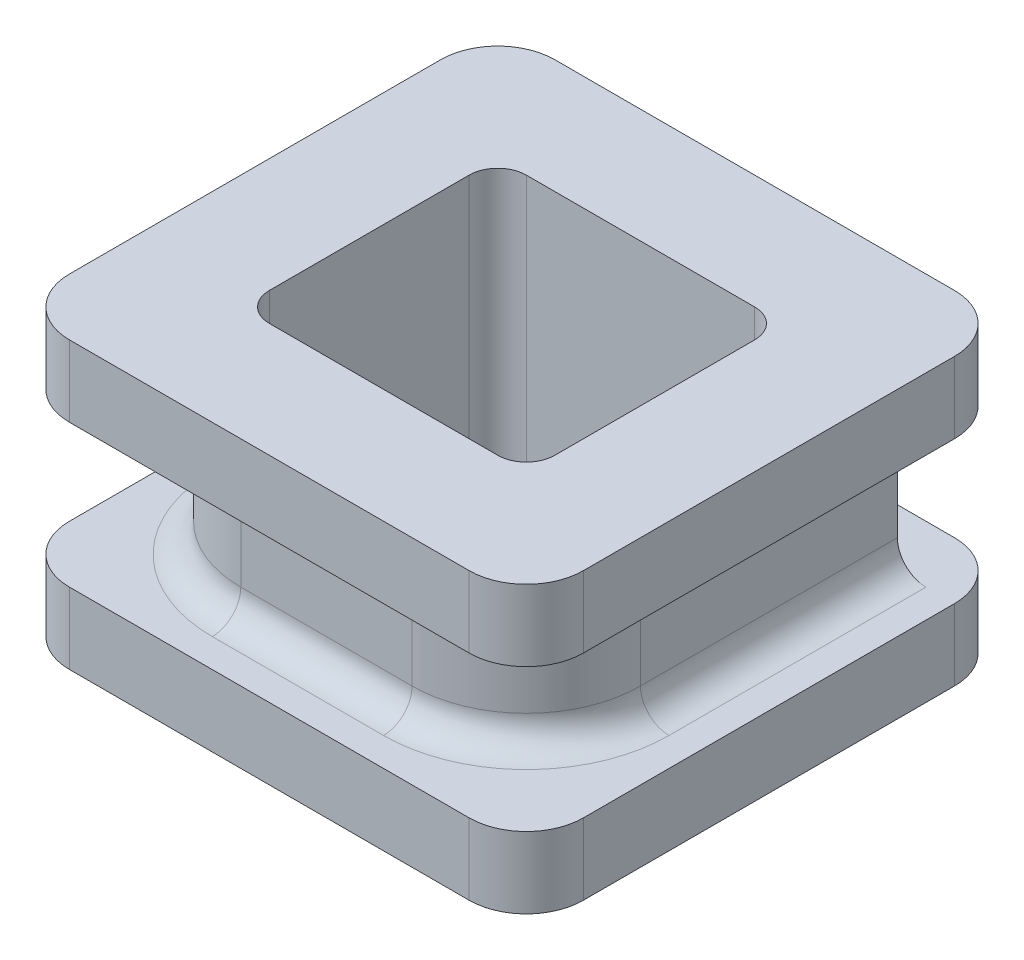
ISO-10303-21;
HEADER;
FILE_DESCRIPTION(('STEP AP214'),'2;1');
FILE_NAME('part.step','',(''),(''),'','','');
FILE_SCHEMA(('AUTOMOTIVE_DESIGN { 1 0 10303 214 1 1 1 1 }'));
ENDSEC;
DATA;
#1=APPLICATION_CONTEXT('core data for automotive mechanical design processes');
#2=APPLICATION_PROTOCOL_DEFINITION('international standard','automotive_design',2000,#1);
#3=PRODUCT_CONTEXT('',#1,'mechanical');
#4=PRODUCT('Part','Part','',(#3));
#5=PRODUCT_RELATED_PRODUCT_CATEGORY('part','',(#4));
#6=PRODUCT_DEFINITION_FORMATION('','',#4);
#7=PRODUCT_DEFINITION_CONTEXT('part definition',#1,'design');
#8=PRODUCT_DEFINITION('design','',#6,#7);
#9=PRODUCT_DEFINITION_SHAPE('','',#8);
#10=(LENGTH_UNIT() NAMED_UNIT(*) SI_UNIT(.MILLI.,.METRE.));
#11=(NAMED_UNIT(*) PLANE_ANGLE_UNIT() SI_UNIT($,.RADIAN.));
#12=(NAMED_UNIT(*) SI_UNIT($,.STERADIAN.) SOLID_ANGLE_UNIT());
#13=UNCERTAINTY_MEASURE_WITH_UNIT(LENGTH_MEASURE(1.E-05),#10,'distance_accuracy_value','');
#14=(GEOMETRIC_REPRESENTATION_CONTEXT(3) GLOBAL_UNCERTAINTY_ASSIGNED_CONTEXT((#13)) GLOBAL_UNIT_ASSIGNED_CONTEXT((#10,
#11,#12)) REPRESENTATION_CONTEXT('',''));
#15=CARTESIAN_POINT('',(0.,0.,0.));
#16=DIRECTION('',(0.,0.,1.));
#17=DIRECTION('',(1.,0.,0.));
#18=AXIS2_PLACEMENT_3D('',#15,#16,#17);
#19=CARTESIAN_POINT('',(14.,5.,0.));
#20=DIRECTION('',(1.,0.,0.));
#21=DIRECTION('',(0.,0.,-1.));
#22=AXIS2_PLACEMENT_3D('',#19,#20,#21);
#23=PLANE('',#22);
#24=DIRECTION('',(0.,0.,1.));
#25=VECTOR('',#24,1.);
#26=CARTESIAN_POINT('',(14.,-5.,0.));
#27=LINE('',#26,#25);
#28=CARTESIAN_POINT('',(14.,-5.,-11.));
#29=VERTEX_POINT('',#28);
#30=CARTESIAN_POINT('',(14.,-5.,2.));
#31=VERTEX_POINT('',#30);
#32=EDGE_CURVE('E478',#29,#31,#27,.T.);
#33=ORIENTED_EDGE('',*,*,#32,.F.);
#34=DIRECTION('',(0.,-1.,0.));
#35=VECTOR('',#34,1.);
#36=CARTESIAN_POINT('',(14.,5.,-11.));
#37=LINE('',#36,#35);
#38=CARTESIAN_POINT('',(14.,-2.5,-11.));
#39=VERTEX_POINT('',#38);
#40=EDGE_CURVE('E400',#29,#39,#37,.F.);
#41=ORIENTED_EDGE('',*,*,#40,.T.);
#42=DIRECTION('',(0.,0.,1.));
#43=VECTOR('',#42,1.);
#44=CARTESIAN_POINT('',(14.,-2.5,-13.));
#45=LINE('',#44,#43);
#46=CARTESIAN_POINT('',(14.,-2.5,2.));
#47=VERTEX_POINT('',#46);
#48=EDGE_CURVE('E579',#39,#47,#45,.T.);
#49=ORIENTED_EDGE('',*,*,#48,.T.);
#50=DIRECTION('',(0.,-1.,0.));
#51=VECTOR('',#50,1.);
#52=CARTESIAN_POINT('',(14.,-5.,2.));
#53=LINE('',#52,#51);
#54=EDGE_CURVE('E397',#47,#31,#53,.T.);
#55=ORIENTED_EDGE('',*,*,#54,.T.);
#56=EDGE_LOOP('',(#33,#41,#49,#55));
#57=FACE_BOUND('',#56,.T.);
#58=ADVANCED_FACE('F59',(#57),#23,.T.);
#59=CARTESIAN_POINT('',(0.,5.,-13.));
#60=DIRECTION('',(0.,0.,-1.));
#61=DIRECTION('',(-1.,0.,0.));
#62=AXIS2_PLACEMENT_3D('',#59,#60,#61);
#63=PLANE('',#62);
#64=DIRECTION('',(1.,0.,0.));
#65=VECTOR('',#64,1.);
#66=CARTESIAN_POINT('',(0.,-5.,-13.));
#67=LINE('',#66,#65);
#68=CARTESIAN_POINT('',(-2.,-5.,-13.));
#69=VERTEX_POINT('',#68);
#70=CARTESIAN_POINT('',(12.,-5.,-13.));
#71=VERTEX_POINT('',#70);
#72=EDGE_CURVE('E481',#69,#71,#67,.T.);
#73=ORIENTED_EDGE('',*,*,#72,.F.);
#74=DIRECTION('',(0.,-1.,0.));
#75=VECTOR('',#74,1.);
#76=CARTESIAN_POINT('',(-2.,-2.5,-13.));
#77=LINE('',#76,#75);
#78=CARTESIAN_POINT('',(-2.,-2.5,-13.));
#79=VERTEX_POINT('',#78);
#80=EDGE_CURVE('E361',#69,#79,#77,.F.);
#81=ORIENTED_EDGE('',*,*,#80,.T.);
#82=DIRECTION('',(1.,0.,0.));
#83=VECTOR('',#82,1.);
#84=CARTESIAN_POINT('',(-4.,-2.5,-13.));
#85=LINE('',#84,#83);
#86=CARTESIAN_POINT('',(12.,-2.5,-13.));
#87=VERTEX_POINT('',#86);
#88=EDGE_CURVE('E482',#79,#87,#85,.T.);
#89=ORIENTED_EDGE('',*,*,#88,.T.);
#90=DIRECTION('',(0.,-1.,0.));
#91=VECTOR('',#90,1.);
#92=CARTESIAN_POINT('',(12.,5.,-13.));
#93=LINE('',#92,#91);
#94=EDGE_CURVE('E358',#87,#71,#93,.T.);
#95=ORIENTED_EDGE('',*,*,#94,.T.);
#96=EDGE_LOOP('',(#73,#81,#89,#95));
#97=FACE_BOUND('',#96,.T.);
#98=ADVANCED_FACE('F632',(#97),#63,.T.);
#99=CARTESIAN_POINT('',(-4.,5.,0.));
#100=DIRECTION('',(1.,0.,0.));
#101=DIRECTION('',(0.,0.,-1.));
#102=AXIS2_PLACEMENT_3D('',#99,#100,#101);
#103=PLANE('',#102);
#104=DIRECTION('',(0.,0.,1.));
#105=VECTOR('',#104,1.);
#106=CARTESIAN_POINT('',(-4.,-2.5,-13.));
#107=LINE('',#106,#105);
#108=CARTESIAN_POINT('',(-4.,-2.5,-11.));
#109=VERTEX_POINT('',#108);
#110=CARTESIAN_POINT('',(-4.,-2.5,2.));
#111=VERTEX_POINT('',#110);
#112=EDGE_CURVE('E572',#109,#111,#107,.T.);
#113=ORIENTED_EDGE('',*,*,#112,.F.);
#114=DIRECTION('',(0.,-1.,0.));
#115=VECTOR('',#114,1.);
#116=CARTESIAN_POINT('',(-4.,-5.,-11.));
#117=LINE('',#116,#115);
#118=CARTESIAN_POINT('',(-4.,-5.,-11.));
#119=VERTEX_POINT('',#118);
#120=EDGE_CURVE('E346',#109,#119,#117,.T.);
#121=ORIENTED_EDGE('',*,*,#120,.T.);
#122=DIRECTION('',(0.,0.,1.));
#123=VECTOR('',#122,1.);
#124=CARTESIAN_POINT('',(-4.,-5.,0.));
#125=LINE('',#124,#123);
#126=CARTESIAN_POINT('',(-4.,-5.,2.));
#127=VERTEX_POINT('',#126);
#128=EDGE_CURVE('E485',#119,#127,#125,.T.);
#129=ORIENTED_EDGE('',*,*,#128,.T.);
#130=DIRECTION('',(0.,-1.,0.));
#131=VECTOR('',#130,1.);
#132=CARTESIAN_POINT('',(-4.,5.,2.));
#133=LINE('',#132,#131);
#134=EDGE_CURVE('E344',#127,#111,#133,.F.);
#135=ORIENTED_EDGE('',*,*,#134,.T.);
#136=EDGE_LOOP('',(#113,#121,#129,#135));
#137=FACE_BOUND('',#136,.T.);
#138=ADVANCED_FACE('F639',(#137),#103,.F.);
#139=CARTESIAN_POINT('',(0.,5.,4.));
#140=DIRECTION('',(0.,0.,-1.));
#141=DIRECTION('',(-1.,0.,0.));
#142=AXIS2_PLACEMENT_3D('',#139,#140,#141);
#143=PLANE('',#142);
#144=DIRECTION('',(1.,0.,0.));
#145=VECTOR('',#144,1.);
#146=CARTESIAN_POINT('',(0.,-5.,4.));
#147=LINE('',#146,#145);
#148=CARTESIAN_POINT('',(-2.,-5.,4.));
#149=VERTEX_POINT('',#148);
#150=CARTESIAN_POINT('',(12.,-5.,4.));
#151=VERTEX_POINT('',#150);
#152=EDGE_CURVE('E488',#149,#151,#147,.T.);
#153=ORIENTED_EDGE('',*,*,#152,.T.);
#154=DIRECTION('',(0.,-1.,0.));
#155=VECTOR('',#154,1.);
#156=CARTESIAN_POINT('',(12.,-2.5,4.));
#157=LINE('',#156,#155);
#158=CARTESIAN_POINT('',(12.,-2.5,4.));
#159=VERTEX_POINT('',#158);
#160=EDGE_CURVE('E415',#151,#159,#157,.F.);
#161=ORIENTED_EDGE('',*,*,#160,.T.);
#162=DIRECTION('',(1.,0.,0.));
#163=VECTOR('',#162,1.);
#164=CARTESIAN_POINT('',(-4.,-2.5,4.));
#165=LINE('',#164,#163);
#166=CARTESIAN_POINT('',(-2.,-2.5,4.));
#167=VERTEX_POINT('',#166);
#168=EDGE_CURVE('E575',#167,#159,#165,.T.);
#169=ORIENTED_EDGE('',*,*,#168,.F.);
#170=DIRECTION('',(0.,-1.,0.));
#171=VECTOR('',#170,1.);
#172=CARTESIAN_POINT('',(-2.,5.,4.));
#173=LINE('',#172,#171);
#174=EDGE_CURVE('E412',#167,#149,#173,.T.);
#175=ORIENTED_EDGE('',*,*,#174,.T.);
#176=EDGE_LOOP('',(#153,#161,#169,#175));
#177=FACE_BOUND('',#176,.T.);
#178=ADVANCED_FACE('F846',(#177),#143,.F.);
#179=CARTESIAN_POINT('',(10.,5.,0.));
#180=DIRECTION('',(-1.,0.,0.));
#181=DIRECTION('',(0.,0.,1.));
#182=AXIS2_PLACEMENT_3D('',#179,#180,#181);
#183=PLANE('',#182);
#184=DIRECTION('',(0.,0.,-1.));
#185=VECTOR('',#184,1.);
#186=CARTESIAN_POINT('',(10.,5.,0.));
#187=LINE('',#186,#185);
#188=CARTESIAN_POINT('',(10.,5.,-1.));
#189=VERTEX_POINT('',#188);
#190=CARTESIAN_POINT('',(10.,5.,-8.));
#191=VERTEX_POINT('',#190);
#192=EDGE_CURVE('E474',#189,#191,#187,.T.);
#193=ORIENTED_EDGE('',*,*,#192,.T.);
#194=DIRECTION('',(0.,-1.,0.));
#195=VECTOR('',#194,1.);
#196=CARTESIAN_POINT('',(10.,5.,-8.));
#197=LINE('',#196,#195);
#198=CARTESIAN_POINT('',(10.,-5.,-8.));
#199=VERTEX_POINT('',#198);
#200=EDGE_CURVE('E419',#191,#199,#197,.T.);
#201=ORIENTED_EDGE('',*,*,#200,.T.);
#202=DIRECTION('',(0.,0.,-1.));
#203=VECTOR('',#202,1.);
#204=CARTESIAN_POINT('',(10.,-5.,0.));
#205=LINE('',#204,#203);
#206=CARTESIAN_POINT('',(10.,-5.,-1.));
#207=VERTEX_POINT('',#206);
#208=EDGE_CURVE('E457',#207,#199,#205,.T.);
#209=ORIENTED_EDGE('',*,*,#208,.F.);
#210=DIRECTION('',(0.,-1.,0.));
#211=VECTOR('',#210,1.);
#212=CARTESIAN_POINT('',(10.,5.,-1.));
#213=LINE('',#212,#211);
#214=EDGE_CURVE('E417',#207,#189,#213,.F.);
#215=ORIENTED_EDGE('',*,*,#214,.T.);
#216=EDGE_LOOP('',(#193,#201,#209,#215));
#217=FACE_BOUND('',#216,.T.);
#218=ADVANCED_FACE('F607',(#217),#183,.T.);
#219=CARTESIAN_POINT('',(0.,5.,0.));
#220=DIRECTION('',(0.,0.,-1.));
#221=DIRECTION('',(-1.,0.,0.));
#222=AXIS2_PLACEMENT_3D('',#219,#220,#221);
#223=PLANE('',#222);
#224=DIRECTION('',(1.,0.,0.));
#225=VECTOR('',#224,1.);
#226=CARTESIAN_POINT('',(0.,5.,0.));
#227=LINE('',#226,#225);
#228=CARTESIAN_POINT('',(1.,5.,0.));
#229=VERTEX_POINT('',#228);
#230=CARTESIAN_POINT('',(9.,5.,0.));
#231=VERTEX_POINT('',#230);
#232=EDGE_CURVE('E465',#229,#231,#227,.T.);
#233=ORIENTED_EDGE('',*,*,#232,.T.);
#234=DIRECTION('',(0.,-1.,0.));
#235=VECTOR('',#234,1.);
#236=CARTESIAN_POINT('',(9.,-5.,0.));
#237=LINE('',#236,#235);
#238=CARTESIAN_POINT('',(9.,-5.,0.));
#239=VERTEX_POINT('',#238);
#240=EDGE_CURVE('E433',#231,#239,#237,.T.);
#241=ORIENTED_EDGE('',*,*,#240,.T.);
#242=DIRECTION('',(1.,0.,0.));
#243=VECTOR('',#242,1.);
#244=CARTESIAN_POINT('',(0.,-5.,0.));
#245=LINE('',#244,#243);
#246=CARTESIAN_POINT('',(1.,-5.,0.));
#247=VERTEX_POINT('',#246);
#248=EDGE_CURVE('E450',#247,#239,#245,.T.);
#249=ORIENTED_EDGE('',*,*,#248,.F.);
#250=DIRECTION('',(0.,-1.,0.));
#251=VECTOR('',#250,1.);
#252=CARTESIAN_POINT('',(1.,5.,0.));
#253=LINE('',#252,#251);
#254=EDGE_CURVE('E81',#247,#229,#253,.F.);
#255=ORIENTED_EDGE('',*,*,#254,.T.);
#256=EDGE_LOOP('',(#233,#241,#249,#255));
#257=FACE_BOUND('',#256,.T.);
#258=ADVANCED_FACE('F455',(#257),#223,.T.);
#259=CARTESIAN_POINT('',(0.,5.,0.));
#260=DIRECTION('',(-1.,0.,0.));
#261=DIRECTION('',(0.,0.,1.));
#262=AXIS2_PLACEMENT_3D('',#259,#260,#261);
#263=PLANE('',#262);
#264=DIRECTION('',(0.,0.,-1.));
#265=VECTOR('',#264,1.);
#266=CARTESIAN_POINT('',(0.,-5.,0.));
#267=LINE('',#266,#265);
#268=CARTESIAN_POINT('',(0.,-5.,-1.));
#269=VERTEX_POINT('',#268);
#270=CARTESIAN_POINT('',(0.,-5.,-8.));
#271=VERTEX_POINT('',#270);
#272=EDGE_CURVE('E452',#269,#271,#267,.T.);
#273=ORIENTED_EDGE('',*,*,#272,.T.);
#274=DIRECTION('',(0.,-1.,0.));
#275=VECTOR('',#274,1.);
#276=CARTESIAN_POINT('',(0.,5.,-8.));
#277=LINE('',#276,#275);
#278=CARTESIAN_POINT('',(0.,5.,-8.));
#279=VERTEX_POINT('',#278);
#280=EDGE_CURVE('E430',#271,#279,#277,.F.);
#281=ORIENTED_EDGE('',*,*,#280,.T.);
#282=DIRECTION('',(0.,0.,-1.));
#283=VECTOR('',#282,1.);
#284=CARTESIAN_POINT('',(0.,5.,0.));
#285=LINE('',#284,#283);
#286=CARTESIAN_POINT('',(0.,5.,-1.));
#287=VERTEX_POINT('',#286);
#288=EDGE_CURVE('E463',#287,#279,#285,.T.);
#289=ORIENTED_EDGE('',*,*,#288,.F.);
#290=DIRECTION('',(0.,-1.,0.));
#291=VECTOR('',#290,1.);
#292=CARTESIAN_POINT('',(0.,5.,-1.));
#293=LINE('',#292,#291);
#294=EDGE_CURVE('E427',#287,#269,#293,.T.);
#295=ORIENTED_EDGE('',*,*,#294,.T.);
#296=EDGE_LOOP('',(#273,#281,#289,#295));
#297=FACE_BOUND('',#296,.T.);
#298=ADVANCED_FACE('F467',(#297),#263,.F.);
#299=DIRECTION('',(0.,0.,1.));
#300=VECTOR('',#299,1.);
#301=CARTESIAN_POINT('',(14.,2.5,-13.));
#302=LINE('',#301,#300);
#303=CARTESIAN_POINT('',(14.,2.5,-11.));
#304=VERTEX_POINT('',#303);
#305=CARTESIAN_POINT('',(14.,2.5,2.));
#306=VERTEX_POINT('',#305);
#307=EDGE_CURVE('E589',#304,#306,#302,.T.);
#308=ORIENTED_EDGE('',*,*,#307,.F.);
#309=DIRECTION('',(0.,-1.,0.));
#310=VECTOR('',#309,1.);
#311=CARTESIAN_POINT('',(14.,5.,-11.));
#312=LINE('',#311,#310);
#313=CARTESIAN_POINT('',(14.,5.,-11.));
#314=VERTEX_POINT('',#313);
#315=EDGE_CURVE('E405',#304,#314,#312,.F.);
#316=ORIENTED_EDGE('',*,*,#315,.T.);
#317=DIRECTION('',(0.,0.,1.));
#318=VECTOR('',#317,1.);
#319=CARTESIAN_POINT('',(14.,5.,0.));
#320=LINE('',#319,#318);
#321=CARTESIAN_POINT('',(14.,5.,2.));
#322=VERTEX_POINT('',#321);
#323=EDGE_CURVE('E497',#314,#322,#320,.T.);
#324=ORIENTED_EDGE('',*,*,#323,.T.);
#325=DIRECTION('',(0.,-1.,0.));
#326=VECTOR('',#325,1.);
#327=CARTESIAN_POINT('',(14.,2.5,2.));
#328=LINE('',#327,#326);
#329=EDGE_CURVE('E402',#322,#306,#328,.T.);
#330=ORIENTED_EDGE('',*,*,#329,.T.);
#331=EDGE_LOOP('',(#308,#316,#324,#330));
#332=FACE_BOUND('',#331,.T.);
#333=ADVANCED_FACE('F635',(#332),#23,.T.);
#334=DIRECTION('',(1.,0.,0.));
#335=VECTOR('',#334,1.);
#336=CARTESIAN_POINT('',(-4.,2.5,-13.));
#337=LINE('',#336,#335);
#338=CARTESIAN_POINT('',(-2.,2.5,-13.));
#339=VERTEX_POINT('',#338);
#340=CARTESIAN_POINT('',(12.,2.5,-13.));
#341=VERTEX_POINT('',#340);
#342=EDGE_CURVE('E576',#339,#341,#337,.T.);
#343=ORIENTED_EDGE('',*,*,#342,.F.);
#344=DIRECTION('',(0.,-1.,0.));
#345=VECTOR('',#344,1.);
#346=CARTESIAN_POINT('',(-2.,5.,-13.));
#347=LINE('',#346,#345);
#348=CARTESIAN_POINT('',(-2.,5.,-13.));
#349=VERTEX_POINT('',#348);
#350=EDGE_CURVE('E387',#339,#349,#347,.F.);
#351=ORIENTED_EDGE('',*,*,#350,.T.);
#352=DIRECTION('',(1.,0.,0.));
#353=VECTOR('',#352,1.);
#354=CARTESIAN_POINT('',(0.,5.,-13.));
#355=LINE('',#354,#353);
#356=CARTESIAN_POINT('',(12.,5.,-13.));
#357=VERTEX_POINT('',#356);
#358=EDGE_CURVE('E596',#349,#357,#355,.T.);
#359=ORIENTED_EDGE('',*,*,#358,.T.);
#360=DIRECTION('',(0.,-1.,0.));
#361=VECTOR('',#360,1.);
#362=CARTESIAN_POINT('',(12.,5.,-13.));
#363=LINE('',#362,#361);
#364=EDGE_CURVE('E384',#357,#341,#363,.T.);
#365=ORIENTED_EDGE('',*,*,#364,.T.);
#366=EDGE_LOOP('',(#343,#351,#359,#365));
#367=FACE_BOUND('',#366,.T.);
#368=ADVANCED_FACE('F642',(#367),#63,.T.);
#369=DIRECTION('',(0.,0.,1.));
#370=VECTOR('',#369,1.);
#371=CARTESIAN_POINT('',(-4.,5.,0.));
#372=LINE('',#371,#370);
#373=CARTESIAN_POINT('',(-4.,5.,-11.));
#374=VERTEX_POINT('',#373);
#375=CARTESIAN_POINT('',(-4.,5.,2.));
#376=VERTEX_POINT('',#375);
#377=EDGE_CURVE('E599',#374,#376,#372,.T.);
#378=ORIENTED_EDGE('',*,*,#377,.F.);
#379=DIRECTION('',(0.,-1.,0.));
#380=VECTOR('',#379,1.);
#381=CARTESIAN_POINT('',(-4.,2.5,-11.));
#382=LINE('',#381,#380);
#383=CARTESIAN_POINT('',(-4.,2.5,-11.));
#384=VERTEX_POINT('',#383);
#385=EDGE_CURVE('E373',#374,#384,#382,.T.);
#386=ORIENTED_EDGE('',*,*,#385,.T.);
#387=DIRECTION('',(0.,0.,1.));
#388=VECTOR('',#387,1.);
#389=CARTESIAN_POINT('',(-4.,2.5,-13.));
#390=LINE('',#389,#388);
#391=CARTESIAN_POINT('',(-4.,2.5,2.));
#392=VERTEX_POINT('',#391);
#393=EDGE_CURVE('E571',#384,#392,#390,.T.);
#394=ORIENTED_EDGE('',*,*,#393,.T.);
#395=DIRECTION('',(0.,-1.,0.));
#396=VECTOR('',#395,1.);
#397=CARTESIAN_POINT('',(-4.,5.,2.));
#398=LINE('',#397,#396);
#399=EDGE_CURVE('E371',#392,#376,#398,.F.);
#400=ORIENTED_EDGE('',*,*,#399,.T.);
#401=EDGE_LOOP('',(#378,#386,#394,#400));
#402=FACE_BOUND('',#401,.T.);
#403=ADVANCED_FACE('F651',(#402),#103,.F.);
#404=DIRECTION('',(1.,0.,0.));
#405=VECTOR('',#404,1.);
#406=CARTESIAN_POINT('',(-4.,2.5,4.));
#407=LINE('',#406,#405);
#408=CARTESIAN_POINT('',(-2.,2.5,4.));
#409=VERTEX_POINT('',#408);
#410=CARTESIAN_POINT('',(12.,2.5,4.));
#411=VERTEX_POINT('',#410);
#412=EDGE_CURVE('E586',#409,#411,#407,.T.);
#413=ORIENTED_EDGE('',*,*,#412,.T.);
#414=DIRECTION('',(0.,-1.,0.));
#415=VECTOR('',#414,1.);
#416=CARTESIAN_POINT('',(12.,5.,4.));
#417=LINE('',#416,#415);
#418=CARTESIAN_POINT('',(12.,5.,4.));
#419=VERTEX_POINT('',#418);
#420=EDGE_CURVE('E410',#411,#419,#417,.F.);
#421=ORIENTED_EDGE('',*,*,#420,.T.);
#422=DIRECTION('',(1.,0.,0.));
#423=VECTOR('',#422,1.);
#424=CARTESIAN_POINT('',(0.,5.,4.));
#425=LINE('',#424,#423);
#426=CARTESIAN_POINT('',(-2.,5.,4.));
#427=VERTEX_POINT('',#426);
#428=EDGE_CURVE('E602',#427,#419,#425,.T.);
#429=ORIENTED_EDGE('',*,*,#428,.F.);
#430=DIRECTION('',(0.,-1.,0.));
#431=VECTOR('',#430,1.);
#432=CARTESIAN_POINT('',(-2.,5.,4.));
#433=LINE('',#432,#431);
#434=EDGE_CURVE('E407',#427,#409,#433,.T.);
#435=ORIENTED_EDGE('',*,*,#434,.T.);
#436=EDGE_LOOP('',(#413,#421,#429,#435));
#437=FACE_BOUND('',#436,.T.);
#438=ADVANCED_FACE('F681',(#437),#143,.F.);
#439=CARTESIAN_POINT('',(0.,5.,-9.));
#440=DIRECTION('',(0.,0.,-1.));
#441=DIRECTION('',(-1.,0.,0.));
#442=AXIS2_PLACEMENT_3D('',#439,#440,#441);
#443=PLANE('',#442);
#444=DIRECTION('',(1.,0.,0.));
#445=VECTOR('',#444,1.);
#446=CARTESIAN_POINT('',(0.,-5.,-9.));
#447=LINE('',#446,#445);
#448=CARTESIAN_POINT('',(1.,-5.,-9.));
#449=VERTEX_POINT('',#448);
#450=CARTESIAN_POINT('',(9.,-5.,-9.));
#451=VERTEX_POINT('',#450);
#452=EDGE_CURVE('E494',#449,#451,#447,.T.);
#453=ORIENTED_EDGE('',*,*,#452,.T.);
#454=DIRECTION('',(0.,-1.,0.));
#455=VECTOR('',#454,1.);
#456=CARTESIAN_POINT('',(9.,5.,-9.));
#457=LINE('',#456,#455);
#458=CARTESIAN_POINT('',(9.,5.,-9.));
#459=VERTEX_POINT('',#458);
#460=EDGE_CURVE('E425',#451,#459,#457,.F.);
#461=ORIENTED_EDGE('',*,*,#460,.T.);
#462=DIRECTION('',(1.,0.,0.));
#463=VECTOR('',#462,1.);
#464=CARTESIAN_POINT('',(0.,5.,-9.));
#465=LINE('',#464,#463);
#466=CARTESIAN_POINT('',(1.,5.,-9.));
#467=VERTEX_POINT('',#466);
#468=EDGE_CURVE('E469',#467,#459,#465,.T.);
#469=ORIENTED_EDGE('',*,*,#468,.F.);
#470=DIRECTION('',(0.,-1.,0.));
#471=VECTOR('',#470,1.);
#472=CARTESIAN_POINT('',(1.,-5.,-9.));
#473=LINE('',#472,#471);
#474=EDGE_CURVE('E422',#467,#449,#473,.T.);
#475=ORIENTED_EDGE('',*,*,#474,.T.);
#476=EDGE_LOOP('',(#453,#461,#469,#475));
#477=FACE_BOUND('',#476,.T.);
#478=ADVANCED_FACE('F616',(#477),#443,.F.);
#479=CARTESIAN_POINT('',(0.,5.,0.));
#480=DIRECTION('',(0.,1.,0.));
#481=DIRECTION('',(0.,0.,1.));
#482=AXIS2_PLACEMENT_3D('',#479,#480,#481);
#483=PLANE('',#482);
#484=ORIENTED_EDGE('',*,*,#358,.F.);
#485=CARTESIAN_POINT('',(-2.,5.,-11.));
#486=DIRECTION('',(0.,1.,0.));
#487=DIRECTION('',(0.,0.,1.));
#488=AXIS2_PLACEMENT_3D('',#485,#486,#487);
#489=CIRCLE('',#488,2.);
#490=EDGE_CURVE('E395',#349,#374,#489,.T.);
#491=ORIENTED_EDGE('',*,*,#490,.T.);
#492=ORIENTED_EDGE('',*,*,#377,.T.);
#493=CARTESIAN_POINT('',(-2.,5.,2.));
#494=DIRECTION('',(0.,1.,0.));
#495=DIRECTION('',(0.,0.,1.));
#496=AXIS2_PLACEMENT_3D('',#493,#494,#495);
#497=CIRCLE('',#496,2.);
#498=EDGE_CURVE('E389',#376,#427,#497,.T.);
#499=ORIENTED_EDGE('',*,*,#498,.T.);
#500=ORIENTED_EDGE('',*,*,#428,.T.);
#501=CARTESIAN_POINT('',(12.,5.,2.));
#502=DIRECTION('',(0.,1.,0.));
#503=DIRECTION('',(0.,0.,1.));
#504=AXIS2_PLACEMENT_3D('',#501,#502,#503);
#505=CIRCLE('',#504,2.);
#506=EDGE_CURVE('E391',#419,#322,#505,.T.);
#507=ORIENTED_EDGE('',*,*,#506,.T.);
#508=ORIENTED_EDGE('',*,*,#323,.F.);
#509=CARTESIAN_POINT('',(12.,5.,-11.));
#510=DIRECTION('',(0.,1.,0.));
#511=DIRECTION('',(0.,0.,1.));
#512=AXIS2_PLACEMENT_3D('',#509,#510,#511);
#513=CIRCLE('',#512,2.);
#514=EDGE_CURVE('E393',#314,#357,#513,.T.);
#515=ORIENTED_EDGE('',*,*,#514,.T.);
#516=EDGE_LOOP('',(#484,#491,#492,#499,#500,#507,#508,#515));
#517=FACE_BOUND('',#516,.T.);
#518=ORIENTED_EDGE('',*,*,#192,.F.);
#519=CARTESIAN_POINT('',(9.,5.,-1.));
#520=DIRECTION('',(0.,1.,0.));
#521=DIRECTION('',(0.,0.,1.));
#522=AXIS2_PLACEMENT_3D('',#519,#520,#521);
#523=CIRCLE('',#522,1.);
#524=EDGE_CURVE('E74',#189,#231,#523,.F.);
#525=ORIENTED_EDGE('',*,*,#524,.T.);
#526=ORIENTED_EDGE('',*,*,#232,.F.);
#527=CARTESIAN_POINT('',(1.,5.,-1.));
#528=DIRECTION('',(0.,1.,0.));
#529=DIRECTION('',(0.,0.,1.));
#530=AXIS2_PLACEMENT_3D('',#527,#528,#529);
#531=CIRCLE('',#530,1.);
#532=EDGE_CURVE('E12',#229,#287,#531,.F.);
#533=ORIENTED_EDGE('',*,*,#532,.T.);
#534=ORIENTED_EDGE('',*,*,#288,.T.);
#535=CARTESIAN_POINT('',(1.,5.,-8.));
#536=DIRECTION('',(0.,1.,0.));
#537=DIRECTION('',(0.,0.,1.));
#538=AXIS2_PLACEMENT_3D('',#535,#536,#537);
#539=CIRCLE('',#538,1.);
#540=EDGE_CURVE('E442',#279,#467,#539,.F.);
#541=ORIENTED_EDGE('',*,*,#540,.T.);
#542=ORIENTED_EDGE('',*,*,#468,.T.);
#543=CARTESIAN_POINT('',(9.,5.,-8.));
#544=DIRECTION('',(0.,1.,0.));
#545=DIRECTION('',(0.,0.,1.));
#546=AXIS2_PLACEMENT_3D('',#543,#544,#545);
#547=CIRCLE('',#546,1.);
#548=EDGE_CURVE('E438',#459,#191,#547,.F.);
#549=ORIENTED_EDGE('',*,*,#548,.T.);
#550=EDGE_LOOP('',(#518,#525,#526,#533,#534,#541,#542,#549));
#551=FACE_BOUND('',#550,.T.);
#552=ADVANCED_FACE('F462',(#517,#551),#483,.T.);
#553=CARTESIAN_POINT('',(0.,-5.,0.));
#554=DIRECTION('',(0.,1.,0.));
#555=DIRECTION('',(0.,0.,1.));
#556=AXIS2_PLACEMENT_3D('',#553,#554,#555);
#557=PLANE('',#556);
#558=ORIENTED_EDGE('',*,*,#128,.F.);
#559=CARTESIAN_POINT('',(-2.,-5.,-11.));
#560=DIRECTION('',(0.,1.,0.));
#561=DIRECTION('',(0.,0.,1.));
#562=AXIS2_PLACEMENT_3D('',#559,#560,#561);
#563=CIRCLE('',#562,2.);
#564=EDGE_CURVE('E356',#119,#69,#563,.F.);
#565=ORIENTED_EDGE('',*,*,#564,.T.);
#566=ORIENTED_EDGE('',*,*,#72,.T.);
#567=CARTESIAN_POINT('',(12.,-5.,-11.));
#568=DIRECTION('',(0.,1.,0.));
#569=DIRECTION('',(0.,0.,1.));
#570=AXIS2_PLACEMENT_3D('',#567,#568,#569);
#571=CIRCLE('',#570,2.);
#572=EDGE_CURVE('E354',#71,#29,#571,.F.);
#573=ORIENTED_EDGE('',*,*,#572,.T.);
#574=ORIENTED_EDGE('',*,*,#32,.T.);
#575=CARTESIAN_POINT('',(12.,-5.,2.));
#576=DIRECTION('',(0.,1.,0.));
#577=DIRECTION('',(0.,0.,1.));
#578=AXIS2_PLACEMENT_3D('',#575,#576,#577);
#579=CIRCLE('',#578,2.);
#580=EDGE_CURVE('E352',#31,#151,#579,.F.);
#581=ORIENTED_EDGE('',*,*,#580,.T.);
#582=ORIENTED_EDGE('',*,*,#152,.F.);
#583=CARTESIAN_POINT('',(-2.,-5.,2.));
#584=DIRECTION('',(0.,1.,0.));
#585=DIRECTION('',(0.,0.,1.));
#586=AXIS2_PLACEMENT_3D('',#583,#584,#585);
#587=CIRCLE('',#586,2.);
#588=EDGE_CURVE('E350',#149,#127,#587,.F.);
#589=ORIENTED_EDGE('',*,*,#588,.T.);
#590=EDGE_LOOP('',(#558,#565,#566,#573,#574,#581,#582,#589));
#591=FACE_BOUND('',#590,.T.);
#592=ORIENTED_EDGE('',*,*,#248,.T.);
#593=CARTESIAN_POINT('',(9.,-5.,-1.));
#594=DIRECTION('',(0.,1.,0.));
#595=DIRECTION('',(0.,0.,1.));
#596=AXIS2_PLACEMENT_3D('',#593,#594,#595);
#597=CIRCLE('',#596,1.);
#598=EDGE_CURVE('E444',#239,#207,#597,.T.);
#599=ORIENTED_EDGE('',*,*,#598,.T.);
#600=ORIENTED_EDGE('',*,*,#208,.T.);
#601=CARTESIAN_POINT('',(9.,-5.,-8.));
#602=DIRECTION('',(0.,1.,0.));
#603=DIRECTION('',(0.,0.,1.));
#604=AXIS2_PLACEMENT_3D('',#601,#602,#603);
#605=CIRCLE('',#604,1.);
#606=EDGE_CURVE('E436',#199,#451,#605,.T.);
#607=ORIENTED_EDGE('',*,*,#606,.T.);
#608=ORIENTED_EDGE('',*,*,#452,.F.);
#609=CARTESIAN_POINT('',(1.,-5.,-8.));
#610=DIRECTION('',(0.,1.,0.));
#611=DIRECTION('',(0.,0.,1.));
#612=AXIS2_PLACEMENT_3D('',#609,#610,#611);
#613=CIRCLE('',#612,1.);
#614=EDGE_CURVE('E440',#449,#271,#613,.T.);
#615=ORIENTED_EDGE('',*,*,#614,.T.);
#616=ORIENTED_EDGE('',*,*,#272,.F.);
#617=CARTESIAN_POINT('',(1.,-5.,-1.));
#618=DIRECTION('',(0.,1.,0.));
#619=DIRECTION('',(0.,0.,1.));
#620=AXIS2_PLACEMENT_3D('',#617,#618,#619);
#621=CIRCLE('',#620,1.);
#622=EDGE_CURVE('E67',#269,#247,#621,.T.);
#623=ORIENTED_EDGE('',*,*,#622,.T.);
#624=EDGE_LOOP('',(#592,#599,#600,#607,#608,#615,#616,#623));
#625=FACE_BOUND('',#624,.T.);
#626=ADVANCED_FACE('F449',(#591,#625),#557,.F.);
#627=CARTESIAN_POINT('',(0.,-2.5,0.));
#628=DIRECTION('',(0.,1.,0.));
#629=DIRECTION('',(0.,0.,1.));
#630=AXIS2_PLACEMENT_3D('',#627,#628,#629);
#631=PLANE('',#630);
#632=ORIENTED_EDGE('',*,*,#88,.F.);
#633=CARTESIAN_POINT('',(-2.,-2.5,-11.));
#634=DIRECTION('',(0.,1.,0.));
#635=DIRECTION('',(0.,0.,1.));
#636=AXIS2_PLACEMENT_3D('',#633,#634,#635);
#637=CIRCLE('',#636,2.);
#638=EDGE_CURVE('E369',#79,#109,#637,.T.);
#639=ORIENTED_EDGE('',*,*,#638,.T.);
#640=ORIENTED_EDGE('',*,*,#112,.T.);
#641=CARTESIAN_POINT('',(-2.,-2.5,2.));
#642=DIRECTION('',(0.,1.,0.));
#643=DIRECTION('',(0.,0.,1.));
#644=AXIS2_PLACEMENT_3D('',#641,#642,#643);
#645=CIRCLE('',#644,2.);
#646=EDGE_CURVE('E363',#111,#167,#645,.T.);
#647=ORIENTED_EDGE('',*,*,#646,.T.);
#648=ORIENTED_EDGE('',*,*,#168,.T.);
#649=CARTESIAN_POINT('',(12.,-2.5,2.));
#650=DIRECTION('',(0.,1.,0.));
#651=DIRECTION('',(0.,0.,1.));
#652=AXIS2_PLACEMENT_3D('',#649,#650,#651);
#653=CIRCLE('',#652,2.);
#654=EDGE_CURVE('E365',#159,#47,#653,.T.);
#655=ORIENTED_EDGE('',*,*,#654,.T.);
#656=ORIENTED_EDGE('',*,*,#48,.F.);
#657=CARTESIAN_POINT('',(12.,-2.5,-11.));
#658=DIRECTION('',(0.,1.,0.));
#659=DIRECTION('',(0.,0.,1.));
#660=AXIS2_PLACEMENT_3D('',#657,#658,#659);
#661=CIRCLE('',#660,2.);
#662=EDGE_CURVE('E367',#39,#87,#661,.T.);
#663=ORIENTED_EDGE('',*,*,#662,.T.);
#664=EDGE_LOOP('',(#632,#639,#640,#647,#648,#655,#656,#663));
#665=FACE_BOUND('',#664,.T.);
#666=DIRECTION('',(0.,0.,-1.));
#667=VECTOR('',#666,1.);
#668=CARTESIAN_POINT('',(-3.,-2.5,0.));
#669=LINE('',#668,#667);
#670=CARTESIAN_POINT('',(-3.,-2.5,-2.));
#671=VERTEX_POINT('',#670);
#672=CARTESIAN_POINT('',(-3.,-2.5,-11.));
#673=VERTEX_POINT('',#672);
#674=EDGE_CURVE('E330',#671,#673,#669,.T.);
#675=ORIENTED_EDGE('',*,*,#674,.T.);
#676=DIRECTION('',(1.,0.,0.));
#677=VECTOR('',#676,1.);
#678=CARTESIAN_POINT('',(-2.,-2.5,-11.));
#679=LINE('',#678,#677);
#680=CARTESIAN_POINT('',(13.,-2.5,-11.));
#681=VERTEX_POINT('',#680);
#682=EDGE_CURVE('E562',#673,#681,#679,.T.);
#683=ORIENTED_EDGE('',*,*,#682,.T.);
#684=DIRECTION('',(0.,0.,-1.));
#685=VECTOR('',#684,1.);
#686=CARTESIAN_POINT('',(13.,-2.5,-2.));
#687=LINE('',#686,#685);
#688=CARTESIAN_POINT('',(13.,-2.5,-2.));
#689=VERTEX_POINT('',#688);
#690=EDGE_CURVE('E528',#681,#689,#687,.F.);
#691=ORIENTED_EDGE('',*,*,#690,.T.);
#692=CARTESIAN_POINT('',(8.,-2.5,-2.));
#693=DIRECTION('',(0.,1.,0.));
#694=DIRECTION('',(0.,0.,1.));
#695=AXIS2_PLACEMENT_3D('',#692,#693,#694);
#696=CIRCLE('',#695,5.);
#697=CARTESIAN_POINT('',(8.,-2.5,3.));
#698=VERTEX_POINT('',#697);
#699=EDGE_CURVE('E530',#689,#698,#696,.F.);
#700=ORIENTED_EDGE('',*,*,#699,.T.);
#701=DIRECTION('',(1.,0.,0.));
#702=VECTOR('',#701,1.);
#703=CARTESIAN_POINT('',(2.,-2.5,3.));
#704=LINE('',#703,#702);
#705=CARTESIAN_POINT('',(2.,-2.5,3.));
#706=VERTEX_POINT('',#705);
#707=EDGE_CURVE('E532',#698,#706,#704,.F.);
#708=ORIENTED_EDGE('',*,*,#707,.T.);
#709=CARTESIAN_POINT('',(2.,-2.5,-2.));
#710=DIRECTION('',(0.,1.,0.));
#711=DIRECTION('',(0.,0.,1.));
#712=AXIS2_PLACEMENT_3D('',#709,#710,#711);
#713=CIRCLE('',#712,5.);
#714=EDGE_CURVE('E534',#706,#671,#713,.F.);
#715=ORIENTED_EDGE('',*,*,#714,.T.);
#716=EDGE_LOOP('',(#675,#683,#691,#700,#708,#715));
#717=FACE_BOUND('',#716,.T.);
#718=ADVANCED_FACE('F689',(#665,#717),#631,.T.);
#719=CARTESIAN_POINT('',(0.,2.5,0.));
#720=DIRECTION('',(0.,1.,0.));
#721=DIRECTION('',(0.,0.,1.));
#722=AXIS2_PLACEMENT_3D('',#719,#720,#721);
#723=PLANE('',#722);
#724=ORIENTED_EDGE('',*,*,#393,.F.);
#725=CARTESIAN_POINT('',(-2.,2.5,-11.));
#726=DIRECTION('',(0.,1.,0.));
#727=DIRECTION('',(0.,0.,1.));
#728=AXIS2_PLACEMENT_3D('',#725,#726,#727);
#729=CIRCLE('',#728,2.);
#730=EDGE_CURVE('E382',#384,#339,#729,.F.);
#731=ORIENTED_EDGE('',*,*,#730,.T.);
#732=ORIENTED_EDGE('',*,*,#342,.T.);
#733=CARTESIAN_POINT('',(12.,2.5,-11.));
#734=DIRECTION('',(0.,1.,0.));
#735=DIRECTION('',(0.,0.,1.));
#736=AXIS2_PLACEMENT_3D('',#733,#734,#735);
#737=CIRCLE('',#736,2.);
#738=EDGE_CURVE('E380',#341,#304,#737,.F.);
#739=ORIENTED_EDGE('',*,*,#738,.T.);
#740=ORIENTED_EDGE('',*,*,#307,.T.);
#741=CARTESIAN_POINT('',(12.,2.5,2.));
#742=DIRECTION('',(0.,1.,0.));
#743=DIRECTION('',(0.,0.,1.));
#744=AXIS2_PLACEMENT_3D('',#741,#742,#743);
#745=CIRCLE('',#744,2.);
#746=EDGE_CURVE('E378',#306,#411,#745,.F.);
#747=ORIENTED_EDGE('',*,*,#746,.T.);
#748=ORIENTED_EDGE('',*,*,#412,.F.);
#749=CARTESIAN_POINT('',(-2.,2.5,2.));
#750=DIRECTION('',(0.,1.,0.));
#751=DIRECTION('',(0.,0.,1.));
#752=AXIS2_PLACEMENT_3D('',#749,#750,#751);
#753=CIRCLE('',#752,2.);
#754=EDGE_CURVE('E376',#409,#392,#753,.F.);
#755=ORIENTED_EDGE('',*,*,#754,.T.);
#756=EDGE_LOOP('',(#724,#731,#732,#739,#740,#747,#748,#755));
#757=FACE_BOUND('',#756,.T.);
#758=DIRECTION('',(0.,0.,-1.));
#759=VECTOR('',#758,1.);
#760=CARTESIAN_POINT('',(13.,2.5,0.));
#761=LINE('',#760,#759);
#762=CARTESIAN_POINT('',(13.,2.5,-2.));
#763=VERTEX_POINT('',#762);
#764=CARTESIAN_POINT('',(13.,2.5,-11.));
#765=VERTEX_POINT('',#764);
#766=EDGE_CURVE('E511',#763,#765,#761,.T.);
#767=ORIENTED_EDGE('',*,*,#766,.T.);
#768=DIRECTION('',(1.,0.,0.));
#769=VECTOR('',#768,1.);
#770=CARTESIAN_POINT('',(-2.,2.5,-11.));
#771=LINE('',#770,#769);
#772=CARTESIAN_POINT('',(-3.,2.5,-11.));
#773=VERTEX_POINT('',#772);
#774=EDGE_CURVE('E557',#773,#765,#771,.T.);
#775=ORIENTED_EDGE('',*,*,#774,.F.);
#776=DIRECTION('',(0.,0.,-1.));
#777=VECTOR('',#776,1.);
#778=CARTESIAN_POINT('',(-3.,2.5,-2.));
#779=LINE('',#778,#777);
#780=CARTESIAN_POINT('',(-3.,2.5,-2.));
#781=VERTEX_POINT('',#780);
#782=EDGE_CURVE('E514',#773,#781,#779,.F.);
#783=ORIENTED_EDGE('',*,*,#782,.T.);
#784=CARTESIAN_POINT('',(2.,2.5,-2.));
#785=DIRECTION('',(0.,1.,0.));
#786=DIRECTION('',(0.,0.,1.));
#787=AXIS2_PLACEMENT_3D('',#784,#785,#786);
#788=CIRCLE('',#787,5.);
#789=CARTESIAN_POINT('',(2.,2.5,3.));
#790=VERTEX_POINT('',#789);
#791=EDGE_CURVE('E505',#781,#790,#788,.T.);
#792=ORIENTED_EDGE('',*,*,#791,.T.);
#793=DIRECTION('',(1.,0.,0.));
#794=VECTOR('',#793,1.);
#795=CARTESIAN_POINT('',(0.,2.5,3.));
#796=LINE('',#795,#794);
#797=CARTESIAN_POINT('',(8.,2.5,3.));
#798=VERTEX_POINT('',#797);
#799=EDGE_CURVE('E507',#790,#798,#796,.T.);
#800=ORIENTED_EDGE('',*,*,#799,.T.);
#801=CARTESIAN_POINT('',(8.,2.5,-2.));
#802=DIRECTION('',(0.,1.,0.));
#803=DIRECTION('',(0.,0.,1.));
#804=AXIS2_PLACEMENT_3D('',#801,#802,#803);
#805=CIRCLE('',#804,5.);
#806=EDGE_CURVE('E509',#798,#763,#805,.T.);
#807=ORIENTED_EDGE('',*,*,#806,.T.);
#808=EDGE_LOOP('',(#767,#775,#783,#792,#800,#807));
#809=FACE_BOUND('',#808,.T.);
#810=ADVANCED_FACE('F686',(#757,#809),#723,.F.);
#811=CARTESIAN_POINT('',(-2.,-2.5,2.));
#812=DIRECTION('',(1.,0.,0.));
#813=DIRECTION('',(0.,0.,-1.));
#814=AXIS2_PLACEMENT_3D('',#811,#812,#813);
#815=PLANE('',#814);
#816=DIRECTION('',(0.,1.,0.));
#817=VECTOR('',#816,1.);
#818=CARTESIAN_POINT('',(-2.,2.5,-2.));
#819=LINE('',#818,#817);
#820=CARTESIAN_POINT('',(-2.,-1.5,-2.));
#821=VERTEX_POINT('',#820);
#822=CARTESIAN_POINT('',(-2.,1.5,-2.));
#823=VERTEX_POINT('',#822);
#824=EDGE_CURVE('E298',#821,#823,#819,.T.);
#825=ORIENTED_EDGE('',*,*,#824,.T.);
#826=DIRECTION('',(0.,0.,-1.));
#827=VECTOR('',#826,1.);
#828=CARTESIAN_POINT('',(-2.,1.5,-11.));
#829=LINE('',#828,#827);
#830=CARTESIAN_POINT('',(-2.,1.5,-11.));
#831=VERTEX_POINT('',#830);
#832=EDGE_CURVE('E305',#823,#831,#829,.T.);
#833=ORIENTED_EDGE('',*,*,#832,.T.);
#834=DIRECTION('',(0.,1.,0.));
#835=VECTOR('',#834,1.);
#836=CARTESIAN_POINT('',(-2.,-2.5,-11.));
#837=LINE('',#836,#835);
#838=CARTESIAN_POINT('',(-2.,-1.5,-11.));
#839=VERTEX_POINT('',#838);
#840=EDGE_CURVE('E301',#839,#831,#837,.T.);
#841=ORIENTED_EDGE('',*,*,#840,.F.);
#842=DIRECTION('',(0.,0.,-1.));
#843=VECTOR('',#842,1.);
#844=CARTESIAN_POINT('',(-2.,-1.5,2.));
#845=LINE('',#844,#843);
#846=EDGE_CURVE('E294',#839,#821,#845,.F.);
#847=ORIENTED_EDGE('',*,*,#846,.T.);
#848=EDGE_LOOP('',(#825,#833,#841,#847));
#849=FACE_BOUND('',#848,.T.);
#850=ADVANCED_FACE('F296',(#849),#815,.F.);
#851=CARTESIAN_POINT('',(-2.,-2.5,-11.));
#852=DIRECTION('',(0.,0.,1.));
#853=DIRECTION('',(1.,0.,0.));
#854=AXIS2_PLACEMENT_3D('',#851,#852,#853);
#855=PLANE('',#854);
#856=ORIENTED_EDGE('',*,*,#774,.T.);
#857=CARTESIAN_POINT('',(13.,1.5,-11.));
#858=DIRECTION('',(0.,0.,1.));
#859=DIRECTION('',(1.,0.,0.));
#860=AXIS2_PLACEMENT_3D('',#857,#858,#859);
#861=CIRCLE('',#860,1.);
#862=CARTESIAN_POINT('',(12.,1.5,-11.));
#863=VERTEX_POINT('',#862);
#864=EDGE_CURVE('E540',#765,#863,#861,.T.);
#865=ORIENTED_EDGE('',*,*,#864,.T.);
#866=DIRECTION('',(0.,1.,0.));
#867=VECTOR('',#866,1.);
#868=CARTESIAN_POINT('',(12.,-2.5,-11.));
#869=LINE('',#868,#867);
#870=CARTESIAN_POINT('',(12.,-1.5,-11.));
#871=VERTEX_POINT('',#870);
#872=EDGE_CURVE('E565',#871,#863,#869,.T.);
#873=ORIENTED_EDGE('',*,*,#872,.F.);
#874=CARTESIAN_POINT('',(13.,-1.5,-11.));
#875=DIRECTION('',(0.,0.,1.));
#876=DIRECTION('',(1.,0.,0.));
#877=AXIS2_PLACEMENT_3D('',#874,#875,#876);
#878=CIRCLE('',#877,1.);
#879=EDGE_CURVE('E347',#871,#681,#878,.T.);
#880=ORIENTED_EDGE('',*,*,#879,.T.);
#881=ORIENTED_EDGE('',*,*,#682,.F.);
#882=CARTESIAN_POINT('',(-3.,-1.5,-11.));
#883=DIRECTION('',(0.,0.,1.));
#884=DIRECTION('',(1.,0.,0.));
#885=AXIS2_PLACEMENT_3D('',#882,#883,#884);
#886=CIRCLE('',#885,1.);
#887=EDGE_CURVE('E542',#673,#839,#886,.T.);
#888=ORIENTED_EDGE('',*,*,#887,.T.);
#889=ORIENTED_EDGE('',*,*,#840,.T.);
#890=CARTESIAN_POINT('',(-3.,1.5,-11.));
#891=DIRECTION('',(0.,0.,1.));
#892=DIRECTION('',(1.,0.,0.));
#893=AXIS2_PLACEMENT_3D('',#890,#891,#892);
#894=CIRCLE('',#893,1.);
#895=EDGE_CURVE('E326',#831,#773,#894,.T.);
#896=ORIENTED_EDGE('',*,*,#895,.T.);
#897=EDGE_LOOP('',(#856,#865,#873,#880,#881,#888,#889,#896));
#898=FACE_BOUND('',#897,.T.);
#899=ADVANCED_FACE('F697',(#898),#855,.F.);
#900=CARTESIAN_POINT('',(12.,-2.5,2.));
#901=DIRECTION('',(1.,0.,0.));
#902=DIRECTION('',(0.,0.,-1.));
#903=AXIS2_PLACEMENT_3D('',#900,#901,#902);
#904=PLANE('',#903);
#905=ORIENTED_EDGE('',*,*,#872,.T.);
#906=DIRECTION('',(0.,0.,-1.));
#907=VECTOR('',#906,1.);
#908=CARTESIAN_POINT('',(12.,1.5,2.));
#909=LINE('',#908,#907);
#910=CARTESIAN_POINT('',(12.,1.5,-2.));
#911=VERTEX_POINT('',#910);
#912=EDGE_CURVE('E518',#863,#911,#909,.F.);
#913=ORIENTED_EDGE('',*,*,#912,.T.);
#914=DIRECTION('',(0.,1.,0.));
#915=VECTOR('',#914,1.);
#916=CARTESIAN_POINT('',(12.,-2.5,-2.));
#917=LINE('',#916,#915);
#918=CARTESIAN_POINT('',(12.,-1.5,-2.));
#919=VERTEX_POINT('',#918);
#920=EDGE_CURVE('E315',#911,#919,#917,.F.);
#921=ORIENTED_EDGE('',*,*,#920,.T.);
#922=DIRECTION('',(0.,0.,-1.));
#923=VECTOR('',#922,1.);
#924=CARTESIAN_POINT('',(12.,-1.5,-11.));
#925=LINE('',#924,#923);
#926=EDGE_CURVE('E516',#919,#871,#925,.T.);
#927=ORIENTED_EDGE('',*,*,#926,.T.);
#928=EDGE_LOOP('',(#905,#913,#921,#927));
#929=FACE_BOUND('',#928,.T.);
#930=ADVANCED_FACE('F700',(#929),#904,.T.);
#931=CARTESIAN_POINT('',(-2.,-2.5,2.));
#932=DIRECTION('',(0.,0.,1.));
#933=DIRECTION('',(1.,0.,0.));
#934=AXIS2_PLACEMENT_3D('',#931,#932,#933);
#935=PLANE('',#934);
#936=DIRECTION('',(0.,1.,0.));
#937=VECTOR('',#936,1.);
#938=CARTESIAN_POINT('',(8.,-2.5,2.));
#939=LINE('',#938,#937);
#940=CARTESIAN_POINT('',(8.,-1.5,2.));
#941=VERTEX_POINT('',#940);
#942=CARTESIAN_POINT('',(8.,1.5,2.));
#943=VERTEX_POINT('',#942);
#944=EDGE_CURVE('E499',#941,#943,#939,.T.);
#945=ORIENTED_EDGE('',*,*,#944,.T.);
#946=DIRECTION('',(1.,0.,0.));
#947=VECTOR('',#946,1.);
#948=CARTESIAN_POINT('',(-2.,1.5,2.));
#949=LINE('',#948,#947);
#950=CARTESIAN_POINT('',(2.,1.5,2.));
#951=VERTEX_POINT('',#950);
#952=EDGE_CURVE('E526',#943,#951,#949,.F.);
#953=ORIENTED_EDGE('',*,*,#952,.T.);
#954=DIRECTION('',(0.,1.,0.));
#955=VECTOR('',#954,1.);
#956=CARTESIAN_POINT('',(2.,-2.5,2.));
#957=LINE('',#956,#955);
#958=CARTESIAN_POINT('',(2.,-1.5,2.));
#959=VERTEX_POINT('',#958);
#960=EDGE_CURVE('E472',#951,#959,#957,.F.);
#961=ORIENTED_EDGE('',*,*,#960,.T.);
#962=DIRECTION('',(1.,0.,0.));
#963=VECTOR('',#962,1.);
#964=CARTESIAN_POINT('',(8.,-1.5,2.));
#965=LINE('',#964,#963);
#966=EDGE_CURVE('E524',#959,#941,#965,.T.);
#967=ORIENTED_EDGE('',*,*,#966,.T.);
#968=EDGE_LOOP('',(#945,#953,#961,#967));
#969=FACE_BOUND('',#968,.T.);
#970=ADVANCED_FACE('F728',(#969),#935,.T.);
#971=CARTESIAN_POINT('',(8.,-2.5,-2.));
#972=DIRECTION('',(0.,1.,0.));
#973=DIRECTION('',(0.,0.,1.));
#974=AXIS2_PLACEMENT_3D('',#971,#972,#973);
#975=CYLINDRICAL_SURFACE('',#974,4.);
#976=ORIENTED_EDGE('',*,*,#920,.F.);
#977=CARTESIAN_POINT('',(8.,1.5,-2.));
#978=DIRECTION('',(0.,1.,0.));
#979=DIRECTION('',(0.,0.,1.));
#980=AXIS2_PLACEMENT_3D('',#977,#978,#979);
#981=CIRCLE('',#980,4.);
#982=EDGE_CURVE('E522',#911,#943,#981,.F.);
#983=ORIENTED_EDGE('',*,*,#982,.T.);
#984=ORIENTED_EDGE('',*,*,#944,.F.);
#985=CARTESIAN_POINT('',(8.,-1.5,-2.));
#986=DIRECTION('',(0.,1.,0.));
#987=DIRECTION('',(0.,0.,1.));
#988=AXIS2_PLACEMENT_3D('',#985,#986,#987);
#989=CIRCLE('',#988,4.);
#990=EDGE_CURVE('E520',#941,#919,#989,.T.);
#991=ORIENTED_EDGE('',*,*,#990,.T.);
#992=EDGE_LOOP('',(#976,#983,#984,#991));
#993=FACE_BOUND('',#992,.T.);
#994=ADVANCED_FACE('F726',(#993),#975,.T.);
#995=CARTESIAN_POINT('',(2.,-2.5,-2.));
#996=DIRECTION('',(0.,-1.,0.));
#997=DIRECTION('',(0.,0.,-1.));
#998=AXIS2_PLACEMENT_3D('',#995,#996,#997);
#999=CYLINDRICAL_SURFACE('',#998,4.);
#1000=ORIENTED_EDGE('',*,*,#824,.F.);
#1001=CARTESIAN_POINT('',(2.,-1.5,-2.));
#1002=DIRECTION('',(0.,1.,0.));
#1003=DIRECTION('',(0.,0.,1.));
#1004=AXIS2_PLACEMENT_3D('',#1001,#1002,#1003);
#1005=CIRCLE('',#1004,4.);
#1006=EDGE_CURVE('E311',#821,#959,#1005,.T.);
#1007=ORIENTED_EDGE('',*,*,#1006,.T.);
#1008=ORIENTED_EDGE('',*,*,#960,.F.);
#1009=CARTESIAN_POINT('',(2.,1.5,-2.));
#1010=DIRECTION('',(0.,1.,0.));
#1011=DIRECTION('',(0.,0.,1.));
#1012=AXIS2_PLACEMENT_3D('',#1009,#1010,#1011);
#1013=CIRCLE('',#1012,4.);
#1014=EDGE_CURVE('E314',#951,#823,#1013,.F.);
#1015=ORIENTED_EDGE('',*,*,#1014,.T.);
#1016=EDGE_LOOP('',(#1000,#1007,#1008,#1015));
#1017=FACE_BOUND('',#1016,.T.);
#1018=ADVANCED_FACE('F309',(#1017),#999,.T.);
#1019=CARTESIAN_POINT('',(13.,1.5,0.));
#1020=DIRECTION('',(0.,0.,-1.));
#1021=DIRECTION('',(-1.,0.,0.));
#1022=AXIS2_PLACEMENT_3D('',#1019,#1020,#1021);
#1023=CYLINDRICAL_SURFACE('',#1022,1.);
#1024=ORIENTED_EDGE('',*,*,#864,.F.);
#1025=ORIENTED_EDGE('',*,*,#766,.F.);
#1026=CARTESIAN_POINT('',(13.,1.5,-2.));
#1027=DIRECTION('',(0.,0.,-1.));
#1028=DIRECTION('',(-1.,0.,0.));
#1029=AXIS2_PLACEMENT_3D('',#1026,#1027,#1028);
#1030=CIRCLE('',#1029,1.);
#1031=EDGE_CURVE('E335',#911,#763,#1030,.T.);
#1032=ORIENTED_EDGE('',*,*,#1031,.F.);
#1033=ORIENTED_EDGE('',*,*,#912,.F.);
#1034=EDGE_LOOP('',(#1024,#1025,#1032,#1033));
#1035=FACE_BOUND('',#1034,.T.);
#1036=ADVANCED_FACE('F695',(#1035),#1023,.F.);
#1037=CARTESIAN_POINT('',(8.,1.5,-2.));
#1038=DIRECTION('',(0.,1.,0.));
#1039=DIRECTION('',(0.,0.,1.));
#1040=AXIS2_PLACEMENT_3D('',#1037,#1038,#1039);
#1041=TOROIDAL_SURFACE('',#1040,5.,1.);
#1042=ORIENTED_EDGE('',*,*,#1031,.T.);
#1043=ORIENTED_EDGE('',*,*,#806,.F.);
#1044=CARTESIAN_POINT('',(8.,1.5,3.));
#1045=DIRECTION('',(1.,0.,0.));
#1046=DIRECTION('',(0.,0.,-1.));
#1047=AXIS2_PLACEMENT_3D('',#1044,#1045,#1046);
#1048=CIRCLE('',#1047,1.);
#1049=EDGE_CURVE('E550',#943,#798,#1048,.T.);
#1050=ORIENTED_EDGE('',*,*,#1049,.F.);
#1051=ORIENTED_EDGE('',*,*,#982,.F.);
#1052=EDGE_LOOP('',(#1042,#1043,#1050,#1051));
#1053=FACE_BOUND('',#1052,.T.);
#1054=ADVANCED_FACE('F723',(#1053),#1041,.F.);
#1055=CARTESIAN_POINT('',(0.,1.5,3.));
#1056=DIRECTION('',(1.,0.,0.));
#1057=DIRECTION('',(0.,0.,-1.));
#1058=AXIS2_PLACEMENT_3D('',#1055,#1056,#1057);
#1059=CYLINDRICAL_SURFACE('',#1058,1.);
#1060=ORIENTED_EDGE('',*,*,#1049,.T.);
#1061=ORIENTED_EDGE('',*,*,#799,.F.);
#1062=CARTESIAN_POINT('',(2.,1.5,3.));
#1063=DIRECTION('',(1.,0.,0.));
#1064=DIRECTION('',(0.,0.,-1.));
#1065=AXIS2_PLACEMENT_3D('',#1062,#1063,#1064);
#1066=CIRCLE('',#1065,1.);
#1067=EDGE_CURVE('E548',#951,#790,#1066,.T.);
#1068=ORIENTED_EDGE('',*,*,#1067,.F.);
#1069=ORIENTED_EDGE('',*,*,#952,.F.);
#1070=EDGE_LOOP('',(#1060,#1061,#1068,#1069));
#1071=FACE_BOUND('',#1070,.T.);
#1072=ADVANCED_FACE('F722',(#1071),#1059,.F.);
#1073=CARTESIAN_POINT('',(2.,1.5,-2.));
#1074=DIRECTION('',(0.,1.,0.));
#1075=DIRECTION('',(0.,0.,1.));
#1076=AXIS2_PLACEMENT_3D('',#1073,#1074,#1075);
#1077=TOROIDAL_SURFACE('',#1076,5.,1.);
#1078=ORIENTED_EDGE('',*,*,#1067,.T.);
#1079=ORIENTED_EDGE('',*,*,#791,.F.);
#1080=CARTESIAN_POINT('',(-3.,1.5,-2.));
#1081=DIRECTION('',(0.,0.,1.));
#1082=DIRECTION('',(0.,-1.,0.));
#1083=AXIS2_PLACEMENT_3D('',#1080,#1081,#1082);
#1084=CIRCLE('',#1083,1.);
#1085=EDGE_CURVE('E343',#823,#781,#1084,.T.);
#1086=ORIENTED_EDGE('',*,*,#1085,.F.);
#1087=ORIENTED_EDGE('',*,*,#1014,.F.);
#1088=EDGE_LOOP('',(#1078,#1079,#1086,#1087));
#1089=FACE_BOUND('',#1088,.T.);
#1090=ADVANCED_FACE('F720',(#1089),#1077,.F.);
#1091=CARTESIAN_POINT('',(-3.,1.5,2.));
#1092=DIRECTION('',(0.,0.,1.));
#1093=DIRECTION('',(1.,0.,0.));
#1094=AXIS2_PLACEMENT_3D('',#1091,#1092,#1093);
#1095=CYLINDRICAL_SURFACE('',#1094,1.);
#1096=ORIENTED_EDGE('',*,*,#1085,.T.);
#1097=ORIENTED_EDGE('',*,*,#782,.F.);
#1098=ORIENTED_EDGE('',*,*,#895,.F.);
#1099=ORIENTED_EDGE('',*,*,#832,.F.);
#1100=EDGE_LOOP('',(#1096,#1097,#1098,#1099));
#1101=FACE_BOUND('',#1100,.T.);
#1102=ADVANCED_FACE('F717',(#1101),#1095,.F.);
#1103=CARTESIAN_POINT('',(13.,-1.5,2.));
#1104=DIRECTION('',(0.,0.,1.));
#1105=DIRECTION('',(1.,0.,0.));
#1106=AXIS2_PLACEMENT_3D('',#1103,#1104,#1105);
#1107=CYLINDRICAL_SURFACE('',#1106,1.);
#1108=ORIENTED_EDGE('',*,*,#879,.F.);
#1109=ORIENTED_EDGE('',*,*,#926,.F.);
#1110=CARTESIAN_POINT('',(13.,-1.5,-2.));
#1111=DIRECTION('',(0.,0.,-1.));
#1112=DIRECTION('',(-1.,0.,0.));
#1113=AXIS2_PLACEMENT_3D('',#1110,#1111,#1112);
#1114=CIRCLE('',#1113,1.);
#1115=EDGE_CURVE('E340',#689,#919,#1114,.T.);
#1116=ORIENTED_EDGE('',*,*,#1115,.F.);
#1117=ORIENTED_EDGE('',*,*,#690,.F.);
#1118=EDGE_LOOP('',(#1108,#1109,#1116,#1117));
#1119=FACE_BOUND('',#1118,.T.);
#1120=ADVANCED_FACE('F705',(#1119),#1107,.F.);
#1121=CARTESIAN_POINT('',(8.,-1.5,-2.));
#1122=DIRECTION('',(0.,1.,0.));
#1123=DIRECTION('',(0.,0.,1.));
#1124=AXIS2_PLACEMENT_3D('',#1121,#1122,#1123);
#1125=TOROIDAL_SURFACE('',#1124,5.,1.);
#1126=ORIENTED_EDGE('',*,*,#1115,.T.);
#1127=ORIENTED_EDGE('',*,*,#990,.F.);
#1128=CARTESIAN_POINT('',(8.,-1.5,3.));
#1129=DIRECTION('',(1.,0.,0.));
#1130=DIRECTION('',(0.,0.,-1.));
#1131=AXIS2_PLACEMENT_3D('',#1128,#1129,#1130);
#1132=CIRCLE('',#1131,1.);
#1133=EDGE_CURVE('E332',#698,#941,#1132,.T.);
#1134=ORIENTED_EDGE('',*,*,#1133,.F.);
#1135=ORIENTED_EDGE('',*,*,#699,.F.);
#1136=EDGE_LOOP('',(#1126,#1127,#1134,#1135));
#1137=FACE_BOUND('',#1136,.T.);
#1138=ADVANCED_FACE('F710',(#1137),#1125,.F.);
#1139=CARTESIAN_POINT('',(-2.,-1.5,3.));
#1140=DIRECTION('',(-1.,0.,0.));
#1141=DIRECTION('',(0.,0.,1.));
#1142=AXIS2_PLACEMENT_3D('',#1139,#1140,#1141);
#1143=CYLINDRICAL_SURFACE('',#1142,1.);
#1144=ORIENTED_EDGE('',*,*,#1133,.T.);
#1145=ORIENTED_EDGE('',*,*,#966,.F.);
#1146=CARTESIAN_POINT('',(2.,-1.5,3.));
#1147=DIRECTION('',(1.,0.,0.));
#1148=DIRECTION('',(0.,0.,-1.));
#1149=AXIS2_PLACEMENT_3D('',#1146,#1147,#1148);
#1150=CIRCLE('',#1149,1.);
#1151=EDGE_CURVE('E325',#706,#959,#1150,.T.);
#1152=ORIENTED_EDGE('',*,*,#1151,.F.);
#1153=ORIENTED_EDGE('',*,*,#707,.F.);
#1154=EDGE_LOOP('',(#1144,#1145,#1152,#1153));
#1155=FACE_BOUND('',#1154,.T.);
#1156=ADVANCED_FACE('F731',(#1155),#1143,.F.);
#1157=CARTESIAN_POINT('',(2.,-1.5,-2.));
#1158=DIRECTION('',(0.,1.,0.));
#1159=DIRECTION('',(0.,0.,1.));
#1160=AXIS2_PLACEMENT_3D('',#1157,#1158,#1159);
#1161=TOROIDAL_SURFACE('',#1160,5.,1.);
#1162=ORIENTED_EDGE('',*,*,#1151,.T.);
#1163=ORIENTED_EDGE('',*,*,#1006,.F.);
#1164=CARTESIAN_POINT('',(-3.,-1.5,-2.));
#1165=DIRECTION('',(0.,0.,1.));
#1166=DIRECTION('',(1.,0.,0.));
#1167=AXIS2_PLACEMENT_3D('',#1164,#1165,#1166);
#1168=CIRCLE('',#1167,1.);
#1169=EDGE_CURVE('E322',#671,#821,#1168,.T.);
#1170=ORIENTED_EDGE('',*,*,#1169,.F.);
#1171=ORIENTED_EDGE('',*,*,#714,.F.);
#1172=EDGE_LOOP('',(#1162,#1163,#1170,#1171));
#1173=FACE_BOUND('',#1172,.T.);
#1174=ADVANCED_FACE('F320',(#1173),#1161,.F.);
#1175=CARTESIAN_POINT('',(-3.,-1.5,0.));
#1176=DIRECTION('',(0.,0.,-1.));
#1177=DIRECTION('',(-1.,0.,0.));
#1178=AXIS2_PLACEMENT_3D('',#1175,#1176,#1177);
#1179=CYLINDRICAL_SURFACE('',#1178,1.);
#1180=ORIENTED_EDGE('',*,*,#1169,.T.);
#1181=ORIENTED_EDGE('',*,*,#846,.F.);
#1182=ORIENTED_EDGE('',*,*,#887,.F.);
#1183=ORIENTED_EDGE('',*,*,#674,.F.);
#1184=EDGE_LOOP('',(#1180,#1181,#1182,#1183));
#1185=FACE_BOUND('',#1184,.T.);
#1186=ADVANCED_FACE('F328',(#1185),#1179,.F.);
#1187=CARTESIAN_POINT('',(-2.,5.,-11.));
#1188=DIRECTION('',(0.,1.,0.));
#1189=DIRECTION('',(0.,0.,1.));
#1190=AXIS2_PLACEMENT_3D('',#1187,#1188,#1189);
#1191=CYLINDRICAL_SURFACE('',#1190,2.);
#1192=ORIENTED_EDGE('',*,*,#638,.F.);
#1193=ORIENTED_EDGE('',*,*,#80,.F.);
#1194=ORIENTED_EDGE('',*,*,#564,.F.);
#1195=ORIENTED_EDGE('',*,*,#120,.F.);
#1196=EDGE_LOOP('',(#1192,#1193,#1194,#1195));
#1197=FACE_BOUND('',#1196,.T.);
#1198=ADVANCED_FACE('F744',(#1197),#1191,.T.);
#1199=CARTESIAN_POINT('',(-2.,5.,-11.));
#1200=DIRECTION('',(0.,1.,0.));
#1201=DIRECTION('',(0.,0.,1.));
#1202=AXIS2_PLACEMENT_3D('',#1199,#1200,#1201);
#1203=CYLINDRICAL_SURFACE('',#1202,2.);
#1204=ORIENTED_EDGE('',*,*,#490,.F.);
#1205=ORIENTED_EDGE('',*,*,#350,.F.);
#1206=ORIENTED_EDGE('',*,*,#730,.F.);
#1207=ORIENTED_EDGE('',*,*,#385,.F.);
#1208=EDGE_LOOP('',(#1204,#1205,#1206,#1207));
#1209=FACE_BOUND('',#1208,.T.);
#1210=ADVANCED_FACE('F669',(#1209),#1203,.T.);
#1211=CARTESIAN_POINT('',(12.,5.,-11.));
#1212=DIRECTION('',(0.,-1.,0.));
#1213=DIRECTION('',(0.,0.,-1.));
#1214=AXIS2_PLACEMENT_3D('',#1211,#1212,#1213);
#1215=CYLINDRICAL_SURFACE('',#1214,2.);
#1216=ORIENTED_EDGE('',*,*,#662,.F.);
#1217=ORIENTED_EDGE('',*,*,#40,.F.);
#1218=ORIENTED_EDGE('',*,*,#572,.F.);
#1219=ORIENTED_EDGE('',*,*,#94,.F.);
#1220=EDGE_LOOP('',(#1216,#1217,#1218,#1219));
#1221=FACE_BOUND('',#1220,.T.);
#1222=ADVANCED_FACE('F750',(#1221),#1215,.T.);
#1223=CARTESIAN_POINT('',(12.,5.,-11.));
#1224=DIRECTION('',(0.,-1.,0.));
#1225=DIRECTION('',(0.,0.,-1.));
#1226=AXIS2_PLACEMENT_3D('',#1223,#1224,#1225);
#1227=CYLINDRICAL_SURFACE('',#1226,2.);
#1228=ORIENTED_EDGE('',*,*,#514,.F.);
#1229=ORIENTED_EDGE('',*,*,#315,.F.);
#1230=ORIENTED_EDGE('',*,*,#738,.F.);
#1231=ORIENTED_EDGE('',*,*,#364,.F.);
#1232=EDGE_LOOP('',(#1228,#1229,#1230,#1231));
#1233=FACE_BOUND('',#1232,.T.);
#1234=ADVANCED_FACE('F661',(#1233),#1227,.T.);
#1235=CARTESIAN_POINT('',(12.,5.,2.));
#1236=DIRECTION('',(0.,1.,0.));
#1237=DIRECTION('',(0.,0.,1.));
#1238=AXIS2_PLACEMENT_3D('',#1235,#1236,#1237);
#1239=CYLINDRICAL_SURFACE('',#1238,2.);
#1240=ORIENTED_EDGE('',*,*,#506,.F.);
#1241=ORIENTED_EDGE('',*,*,#420,.F.);
#1242=ORIENTED_EDGE('',*,*,#746,.F.);
#1243=ORIENTED_EDGE('',*,*,#329,.F.);
#1244=EDGE_LOOP('',(#1240,#1241,#1242,#1243));
#1245=FACE_BOUND('',#1244,.T.);
#1246=ADVANCED_FACE('F685',(#1245),#1239,.T.);
#1247=CARTESIAN_POINT('',(12.,5.,2.));
#1248=DIRECTION('',(0.,1.,0.));
#1249=DIRECTION('',(0.,0.,1.));
#1250=AXIS2_PLACEMENT_3D('',#1247,#1248,#1249);
#1251=CYLINDRICAL_SURFACE('',#1250,2.);
#1252=ORIENTED_EDGE('',*,*,#654,.F.);
#1253=ORIENTED_EDGE('',*,*,#160,.F.);
#1254=ORIENTED_EDGE('',*,*,#580,.F.);
#1255=ORIENTED_EDGE('',*,*,#54,.F.);
#1256=EDGE_LOOP('',(#1252,#1253,#1254,#1255));
#1257=FACE_BOUND('',#1256,.T.);
#1258=ADVANCED_FACE('F758',(#1257),#1251,.T.);
#1259=CARTESIAN_POINT('',(-2.,5.,2.));
#1260=DIRECTION('',(0.,-1.,0.));
#1261=DIRECTION('',(0.,0.,-1.));
#1262=AXIS2_PLACEMENT_3D('',#1259,#1260,#1261);
#1263=CYLINDRICAL_SURFACE('',#1262,2.);
#1264=ORIENTED_EDGE('',*,*,#646,.F.);
#1265=ORIENTED_EDGE('',*,*,#134,.F.);
#1266=ORIENTED_EDGE('',*,*,#588,.F.);
#1267=ORIENTED_EDGE('',*,*,#174,.F.);
#1268=EDGE_LOOP('',(#1264,#1265,#1266,#1267));
#1269=FACE_BOUND('',#1268,.T.);
#1270=ADVANCED_FACE('F761',(#1269),#1263,.T.);
#1271=CARTESIAN_POINT('',(-2.,5.,2.));
#1272=DIRECTION('',(0.,-1.,0.));
#1273=DIRECTION('',(0.,0.,-1.));
#1274=AXIS2_PLACEMENT_3D('',#1271,#1272,#1273);
#1275=CYLINDRICAL_SURFACE('',#1274,2.);
#1276=ORIENTED_EDGE('',*,*,#498,.F.);
#1277=ORIENTED_EDGE('',*,*,#399,.F.);
#1278=ORIENTED_EDGE('',*,*,#754,.F.);
#1279=ORIENTED_EDGE('',*,*,#434,.F.);
#1280=EDGE_LOOP('',(#1276,#1277,#1278,#1279));
#1281=FACE_BOUND('',#1280,.T.);
#1282=ADVANCED_FACE('F629',(#1281),#1275,.T.);
#1283=CARTESIAN_POINT('',(9.,5.,-8.));
#1284=DIRECTION('',(0.,-1.,0.));
#1285=DIRECTION('',(0.,0.,-1.));
#1286=AXIS2_PLACEMENT_3D('',#1283,#1284,#1285);
#1287=CYLINDRICAL_SURFACE('',#1286,1.);
#1288=ORIENTED_EDGE('',*,*,#548,.F.);
#1289=ORIENTED_EDGE('',*,*,#460,.F.);
#1290=ORIENTED_EDGE('',*,*,#606,.F.);
#1291=ORIENTED_EDGE('',*,*,#200,.F.);
#1292=EDGE_LOOP('',(#1288,#1289,#1290,#1291));
#1293=FACE_BOUND('',#1292,.T.);
#1294=ADVANCED_FACE('F612',(#1293),#1287,.F.);
#1295=CARTESIAN_POINT('',(1.,5.,-8.));
#1296=DIRECTION('',(0.,1.,0.));
#1297=DIRECTION('',(0.,0.,1.));
#1298=AXIS2_PLACEMENT_3D('',#1295,#1296,#1297);
#1299=CYLINDRICAL_SURFACE('',#1298,1.);
#1300=ORIENTED_EDGE('',*,*,#540,.F.);
#1301=ORIENTED_EDGE('',*,*,#280,.F.);
#1302=ORIENTED_EDGE('',*,*,#614,.F.);
#1303=ORIENTED_EDGE('',*,*,#474,.F.);
#1304=EDGE_LOOP('',(#1300,#1301,#1302,#1303));
#1305=FACE_BOUND('',#1304,.T.);
#1306=ADVANCED_FACE('F620',(#1305),#1299,.F.);
#1307=CARTESIAN_POINT('',(9.,5.,-1.));
#1308=DIRECTION('',(0.,1.,0.));
#1309=DIRECTION('',(0.,0.,1.));
#1310=AXIS2_PLACEMENT_3D('',#1307,#1308,#1309);
#1311=CYLINDRICAL_SURFACE('',#1310,1.);
#1312=ORIENTED_EDGE('',*,*,#524,.F.);
#1313=ORIENTED_EDGE('',*,*,#214,.F.);
#1314=ORIENTED_EDGE('',*,*,#598,.F.);
#1315=ORIENTED_EDGE('',*,*,#240,.F.);
#1316=EDGE_LOOP('',(#1312,#1313,#1314,#1315));
#1317=FACE_BOUND('',#1316,.T.);
#1318=ADVANCED_FACE('F622',(#1317),#1311,.F.);
#1319=CARTESIAN_POINT('',(1.,5.,-1.));
#1320=DIRECTION('',(0.,-1.,0.));
#1321=DIRECTION('',(0.,0.,-1.));
#1322=AXIS2_PLACEMENT_3D('',#1319,#1320,#1321);
#1323=CYLINDRICAL_SURFACE('',#1322,1.);
#1324=ORIENTED_EDGE('',*,*,#532,.F.);
#1325=ORIENTED_EDGE('',*,*,#254,.F.);
#1326=ORIENTED_EDGE('',*,*,#622,.F.);
#1327=ORIENTED_EDGE('',*,*,#294,.F.);
#1328=EDGE_LOOP('',(#1324,#1325,#1326,#1327));
#1329=FACE_BOUND('',#1328,.T.);
#1330=ADVANCED_FACE('F61',(#1329),#1323,.F.);
#1331=CLOSED_SHELL('',(#58,#98,#138,#178,#218,#258,#298,#333,#368,#403,#438,#478,#552,#626,#718,
#810,#850,#899,#930,#970,#994,#1018,#1036,#1054,#1072,#1090,#1102,#1120,#1138,#1156,#1174,#1186,
#1198,#1210,#1222,#1234,#1246,#1258,#1270,#1282,#1294,#1306,#1318,#1330));
#1332=MANIFOLD_SOLID_BREP('B2',#1331);
#1333=ADVANCED_BREP_SHAPE_REPRESENTATION('',(#18,#1332),#14);
#1334=SHAPE_DEFINITION_REPRESENTATION(#9,#1333);
ENDSEC;
END-ISO-10303-21;
